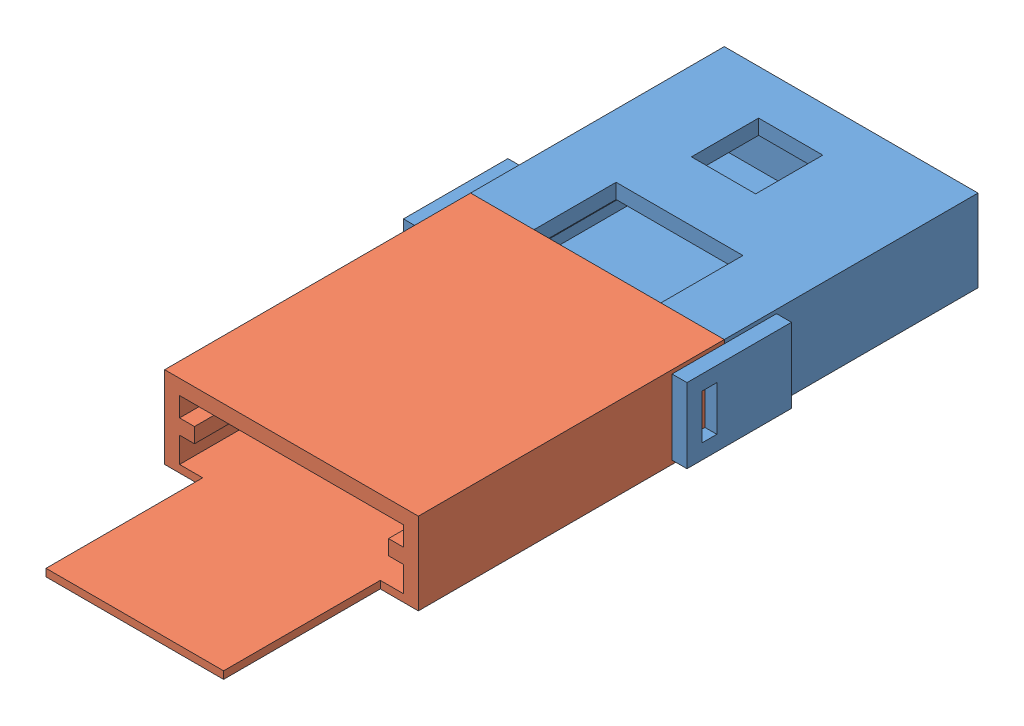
SolidWorks assembly Assem1.SLDASM, configuration Default (file format 9000). Lengths in mm.
Overall size (19 5.5 48).
2 component instances, 2 part files, 3 mates.
Components (placement in the parent):
- Part1-1: Part1.SLDPRT [Default] at (3.9417 9.854 15.3183) size (19 5.5 20.5)
- Part2-1: Part2.SLDPRT [Default] at (3.9417 9.854 39.3183) size (17.6 5.5 31)
Mates (geometry in assembly coordinates):
- Coincident2: coincident aligned: plane of Part1-1 through (12.4417 15.354 23.3183) normal (1 0 0); plane of Part2-1 through (12.4417 9.854 43.8183) normal (1 0 0)
- Coincident3: coincident anti-aligned: plane of Part1-1 through (-3.5583 10.354 23.3183) normal (0 0 1); plane of Part2-1 through (12.4417 9.854 23.3183) normal (0 0 -1)
- Coincident4: coincident aligned: plane of Part1-1 through (3.9417 15.354 15.3183) normal (0 1 0); plane of Part2-1 through (3.9417 15.354 39.3183) normal (0 1 0)
